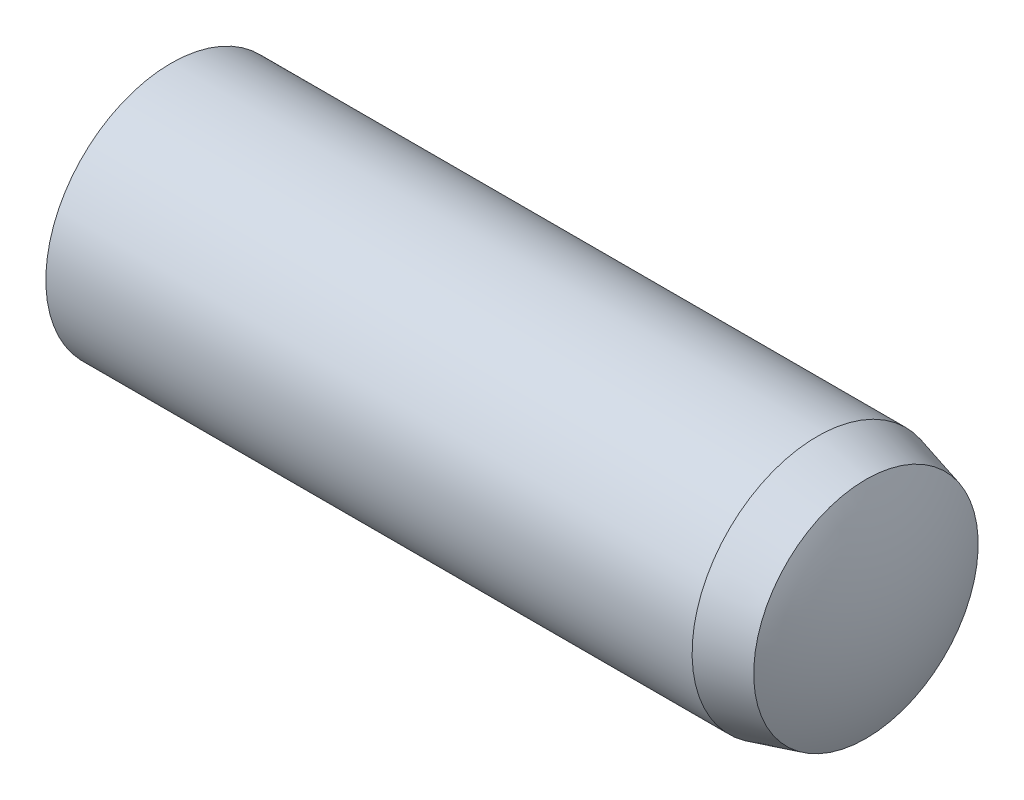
ISO-10303-21;
HEADER;
FILE_DESCRIPTION(('STEP AP214'),'2;1');
FILE_NAME('part.step','',(''),(''),'','','');
FILE_SCHEMA(('AUTOMOTIVE_DESIGN { 1 0 10303 214 1 1 1 1 }'));
ENDSEC;
DATA;
#1=APPLICATION_CONTEXT('core data for automotive mechanical design processes');
#2=APPLICATION_PROTOCOL_DEFINITION('international standard','automotive_design',2000,#1);
#3=PRODUCT_CONTEXT('',#1,'mechanical');
#4=PRODUCT('Part','Part','',(#3));
#5=PRODUCT_RELATED_PRODUCT_CATEGORY('part','',(#4));
#6=PRODUCT_DEFINITION_FORMATION('','',#4);
#7=PRODUCT_DEFINITION_CONTEXT('part definition',#1,'design');
#8=PRODUCT_DEFINITION('design','',#6,#7);
#9=PRODUCT_DEFINITION_SHAPE('','',#8);
#10=(LENGTH_UNIT() NAMED_UNIT(*) SI_UNIT(.MILLI.,.METRE.));
#11=(NAMED_UNIT(*) PLANE_ANGLE_UNIT() SI_UNIT($,.RADIAN.));
#12=(NAMED_UNIT(*) SI_UNIT($,.STERADIAN.) SOLID_ANGLE_UNIT());
#13=UNCERTAINTY_MEASURE_WITH_UNIT(LENGTH_MEASURE(1.E-05),#10,'distance_accuracy_value','');
#14=(GEOMETRIC_REPRESENTATION_CONTEXT(3) GLOBAL_UNCERTAINTY_ASSIGNED_CONTEXT((#13)) GLOBAL_UNIT_ASSIGNED_CONTEXT((#10,
#11,#12)) REPRESENTATION_CONTEXT('',''));
#15=CARTESIAN_POINT('',(0.,0.,0.));
#16=DIRECTION('',(0.,0.,1.));
#17=DIRECTION('',(1.,0.,0.));
#18=AXIS2_PLACEMENT_3D('',#15,#16,#17);
#19=CARTESIAN_POINT('',(11.0166666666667,0.,0.));
#20=DIRECTION('',(-1.,0.,0.));
#21=DIRECTION('',(0.,1.,0.));
#22=AXIS2_PLACEMENT_3D('',#19,#20,#21);
#23=SPHERICAL_SURFACE('',#22,11.0166666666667);
#24=CARTESIAN_POINT('',(1.2,0.,0.));
#25=DIRECTION('',(-1.,0.,0.));
#26=DIRECTION('',(0.,-1.,0.));
#27=AXIS2_PLACEMENT_3D('',#24,#25,#26);
#28=CIRCLE('',#27,5.);
#29=CARTESIAN_POINT('',(1.2,-5.,0.));
#30=VERTEX_POINT('',#29);
#31=EDGE_CURVE('E41',#30,#30,#28,.T.);
#32=ORIENTED_EDGE('',*,*,#31,.T.);
#33=EDGE_LOOP('',(#32));
#34=FACE_BOUND('',#33,.T.);
#35=ADVANCED_FACE('F31',(#34),#23,.T.);
#36=CARTESIAN_POINT('',(20.,0.,0.));
#37=DIRECTION('',(-1.,0.,0.));
#38=DIRECTION('',(0.,-1.,0.));
#39=AXIS2_PLACEMENT_3D('',#36,#37,#38);
#40=SPHERICAL_SURFACE('',#39,10.);
#41=CARTESIAN_POINT('',(28.9402842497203,0.,0.));
#42=DIRECTION('',(-1.,0.,0.));
#43=DIRECTION('',(0.,-1.,0.));
#44=AXIS2_PLACEMENT_3D('',#41,#42,#43);
#45=CIRCLE('',#44,4.48010240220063);
#46=CARTESIAN_POINT('',(28.9402842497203,-4.48010240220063,0.));
#47=VERTEX_POINT('',#46);
#48=EDGE_CURVE('E10',#47,#47,#45,.T.);
#49=ORIENTED_EDGE('',*,*,#48,.F.);
#50=EDGE_LOOP('',(#49));
#51=FACE_BOUND('',#50,.T.);
#52=ADVANCED_FACE('F56',(#51),#40,.T.);
#53=CARTESIAN_POINT('',(28.9402842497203,0.,0.));
#54=DIRECTION('',(-1.,0.,0.));
#55=DIRECTION('',(0.,-1.,0.));
#56=AXIS2_PLACEMENT_3D('',#53,#54,#55);
#57=CONICAL_SURFACE('',#56,4.48010240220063,0.261799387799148);
#58=CARTESIAN_POINT('',(27.,0.,0.));
#59=DIRECTION('',(-1.,0.,0.));
#60=DIRECTION('',(0.,-1.,0.));
#61=AXIS2_PLACEMENT_3D('',#58,#59,#60);
#62=CIRCLE('',#61,5.);
#63=CARTESIAN_POINT('',(27.,-5.,0.));
#64=VERTEX_POINT('',#63);
#65=EDGE_CURVE('E37',#64,#64,#62,.T.);
#66=ORIENTED_EDGE('',*,*,#65,.F.);
#67=EDGE_LOOP('',(#66));
#68=FACE_BOUND('',#67,.T.);
#69=ORIENTED_EDGE('',*,*,#48,.T.);
#70=EDGE_LOOP('',(#69));
#71=FACE_BOUND('',#70,.T.);
#72=ADVANCED_FACE('F51',(#68,#71),#57,.T.);
#73=CARTESIAN_POINT('',(0.,0.,0.));
#74=DIRECTION('',(-1.,0.,0.));
#75=DIRECTION('',(0.,-1.,0.));
#76=AXIS2_PLACEMENT_3D('',#73,#74,#75);
#77=CYLINDRICAL_SURFACE('',#76,5.);
#78=ORIENTED_EDGE('',*,*,#31,.F.);
#79=EDGE_LOOP('',(#78));
#80=FACE_BOUND('',#79,.T.);
#81=ORIENTED_EDGE('',*,*,#65,.T.);
#82=EDGE_LOOP('',(#81));
#83=FACE_BOUND('',#82,.T.);
#84=ADVANCED_FACE('F49',(#80,#83),#77,.T.);
#85=CLOSED_SHELL('',(#35,#52,#72,#84));
#86=MANIFOLD_SOLID_BREP('B2',#85);
#87=ADVANCED_BREP_SHAPE_REPRESENTATION('',(#18,#86),#14);
#88=SHAPE_DEFINITION_REPRESENTATION(#9,#87);
ENDSEC;
END-ISO-10303-21;
